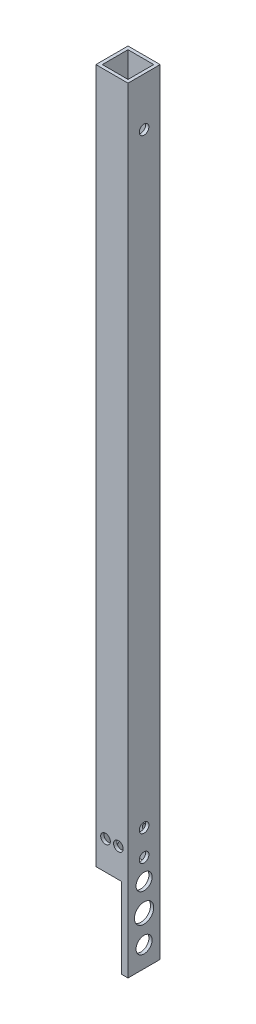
from build123d import *

# Parameters (mm, degrees)
SKETCH_1_W                = 10
SKETCH_1_H                = 10
SKETCH_1_W_2              = 8
SKETCH_1_H_2              = 8
EXTRUDE_1_DEPTH           = 241
CUT_EXTRUDE_2_REACH       = 243.259
SKETCH_3_R                = 1.5
CUT_EXTRUDE_3_REACH       = 243.259
SKETCH_4_R                = 1.5
CUT_EXTRUDE_4_REACH       = 243.259
SKETCH_5_R                = 3
CUT_EXTRUDE_5_REACH       = 243.259
SKETCH_6_R                = 1.5
SKETCH_8_W                = 10
SKETCH_8_H                = 25
CUT_EXTRUDE_7_DEPTH       = 8
HOLE_WIZARD_5_0_5_1_D     = 5
HOLE_WIZARD_5_0_5_1_DEPTH = 1
HOLE_WIZARD_3_0_3_1_D     = 3


with BuildPart() as part:
    # Sketch 1 → Extrude 1 (new body)
    with BuildSketch(Plane(origin=(0, 0, 0), x_dir=(1, 0, 0), z_dir=(0, 1, 0))):
        Rectangle(SKETCH_1_W, SKETCH_1_H)
        Rectangle(SKETCH_1_W_2, SKETCH_1_H_2, mode=Mode.SUBTRACT)
    extrude(amount=EXTRUDE_1_DEPTH)

    # Cut-Extrude 2: up to this face of the body (flat: up to its plane)
    cut_extrude_2_end = Plane(part.part.faces().sort_by_distance((-5, 120.5, 0))[0])
    # Sketch 3 → Cut-Extrude 2 (cut, up to the picked face)
    with BuildSketch(Plane(origin=(5, 0, 0), x_dir=(0, 0, -1), z_dir=(1, 0, 0)), mode=Mode.PRIVATE) as cut_extrude_2_sk1:
        with Locations((0, 226)):
            Circle(SKETCH_3_R)
    cut_extrude_2_tool1 = split(extrude(cut_extrude_2_sk1.sketch, amount=-CUT_EXTRUDE_2_REACH, mode=Mode.PRIVATE), bisect_by=cut_extrude_2_end, keep=Keep.BOTH, mode=Mode.PRIVATE)
    add(cut_extrude_2_tool1.solids().sort_by(Axis((5, 226, 0), (-1, 0, 0)))[0], mode=Mode.SUBTRACT)

    # Cut-Extrude 3: up to this face of the body (flat: up to its plane)
    cut_extrude_3_end = Plane(part.part.faces().sort_by_distance((0, 120.5, -5))[0])
    # Sketch 4 → Cut-Extrude 3 (cut, up to the picked face)
    with BuildSketch(Plane.XY.offset(5), mode=Mode.PRIVATE) as cut_extrude_3_sk1:
        with Locations((0, 8)):
            Circle(SKETCH_4_R)
    cut_extrude_3_tool1 = split(extrude(cut_extrude_3_sk1.sketch, amount=-CUT_EXTRUDE_3_REACH, mode=Mode.PRIVATE), bisect_by=cut_extrude_3_end, keep=Keep.BOTH, mode=Mode.PRIVATE)
    add(cut_extrude_3_tool1.solids().sort_by(Axis((0, 8, 5), (0, 0, -1)))[0], mode=Mode.SUBTRACT)

    # Cut-Extrude 4: up to this face of the body (flat: up to its plane)
    cut_extrude_4_end = Plane(part.part.faces().sort_by_distance((5, 120.189655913, 0))[0])
    # Sketch 5 → Cut-Extrude 4 (cut, up to the picked face)
    with BuildSketch(Plane.ZY.offset(5), mode=Mode.PRIVATE) as cut_extrude_4_sk1:
        with Locations((0, 15)):
            Circle(SKETCH_5_R)
    cut_extrude_4_tool1 = split(extrude(cut_extrude_4_sk1.sketch, amount=-CUT_EXTRUDE_4_REACH, mode=Mode.PRIVATE), bisect_by=cut_extrude_4_end, keep=Keep.BOTH, mode=Mode.PRIVATE)
    add(cut_extrude_4_tool1.solids().sort_by(Axis((-5, 15, 0), (1, 0, 0)))[0], mode=Mode.SUBTRACT)

    # Cut-Extrude 5: up to this face of the body (flat: up to its plane)
    cut_extrude_5_end = Plane(part.part.faces().sort_by_distance((-5, 121.442117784, 0))[0])
    # Sketch 6 → Cut-Extrude 5 (cut, up to the picked face)
    with BuildSketch(Plane(origin=(5, 0, 0), x_dir=(0, 0, -1), z_dir=(1, 0, 0)), mode=Mode.PRIVATE) as cut_extrude_5_sk1:
        with Locations((0, 30)):
            Circle(SKETCH_6_R)
    cut_extrude_5_tool1 = split(extrude(cut_extrude_5_sk1.sketch, amount=-CUT_EXTRUDE_5_REACH, mode=Mode.PRIVATE), bisect_by=cut_extrude_5_end, keep=Keep.BOTH, mode=Mode.PRIVATE)
    # Sketch 6 → Cut-Extrude 5 (cut, up to the picked face)
    with BuildSketch(Plane(origin=(5, 0, 0), x_dir=(0, 0, -1), z_dir=(1, 0, 0)), mode=Mode.PRIVATE) as cut_extrude_5_sk2:
        with Locations((0, 38)):
            Circle(SKETCH_6_R)
    cut_extrude_5_tool2 = split(extrude(cut_extrude_5_sk2.sketch, amount=-CUT_EXTRUDE_5_REACH, mode=Mode.PRIVATE), bisect_by=cut_extrude_5_end, keep=Keep.BOTH, mode=Mode.PRIVATE)
    add(cut_extrude_5_tool1.solids().sort_by(Axis((5, 30, 0), (-1, 0, 0)))[0], mode=Mode.SUBTRACT)
    add(cut_extrude_5_tool2.solids().sort_by(Axis((5, 38, 0), (-1, 0, 0)))[0], mode=Mode.SUBTRACT)

    # Sketch 8 → Cut-Extrude 7 (cut)
    with BuildSketch(Plane.ZY.offset(5)):
        with Locations((0, 12.5)):
            Rectangle(SKETCH_8_W, SKETCH_8_H)
    extrude(amount=-CUT_EXTRUDE_7_DEPTH, mode=Mode.SUBTRACT)

    # Hole Wizard 5.0 _5_ _1
    with Locations(Plane.ZY.offset(-4)):
        with Locations((0, 23.5), (0, 6.5)):
            Hole(HOLE_WIZARD_5_0_5_1_D / 2, depth=HOLE_WIZARD_5_0_5_1_DEPTH)

    # Hole Wizard 3.0 _3_ _1 (through all)
    with Locations(Plane.XY.offset(5)):
        with Locations((2, 34), (-2, 34)):
            Hole(HOLE_WIZARD_3_0_3_1_D / 2)


solid = part.part
